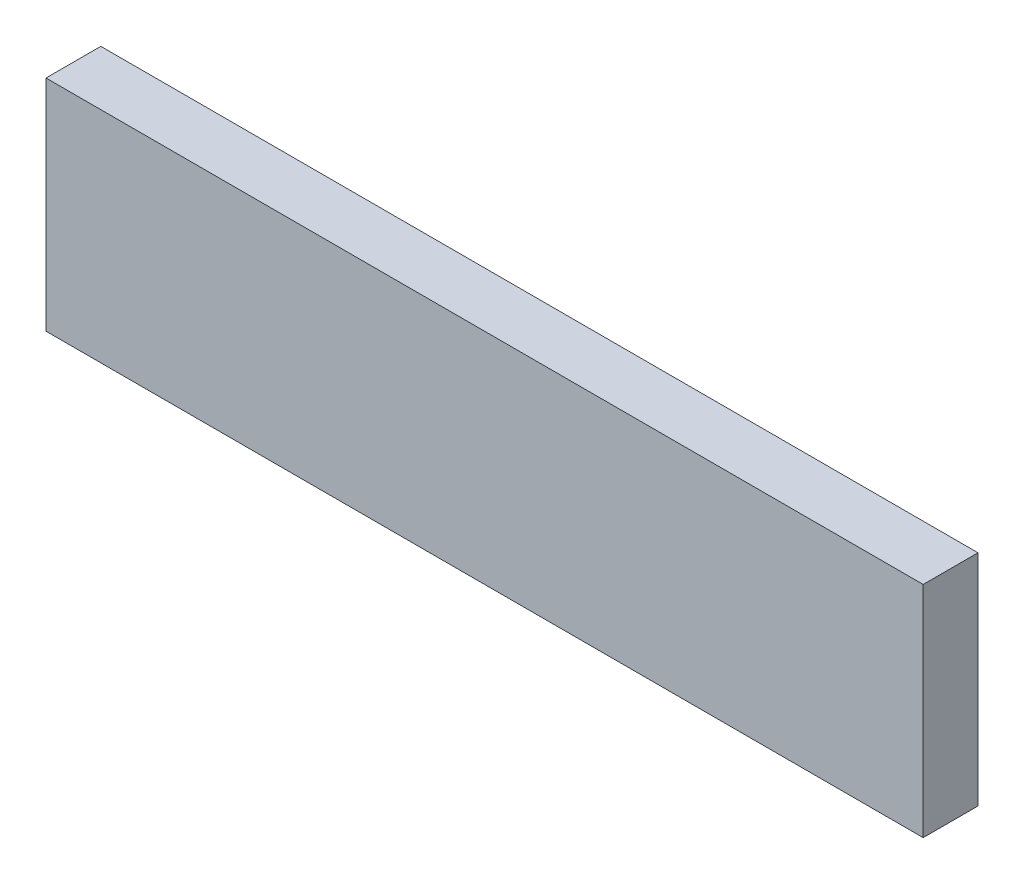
from build123d import *

# Parameters (mm, degrees)
SKETCH1_W      = 101.6
SKETCH1_H      = 25.4
EXTRUDE1_DEPTH = 6.35


with BuildPart() as part:
    # Sketch1 → Extrude1 (new body)
    with BuildSketch(Plane.XY):
        with Locations((50.8, 12.7)):
            Rectangle(SKETCH1_W, SKETCH1_H)
    extrude(amount=-EXTRUDE1_DEPTH)


solid = part.part
